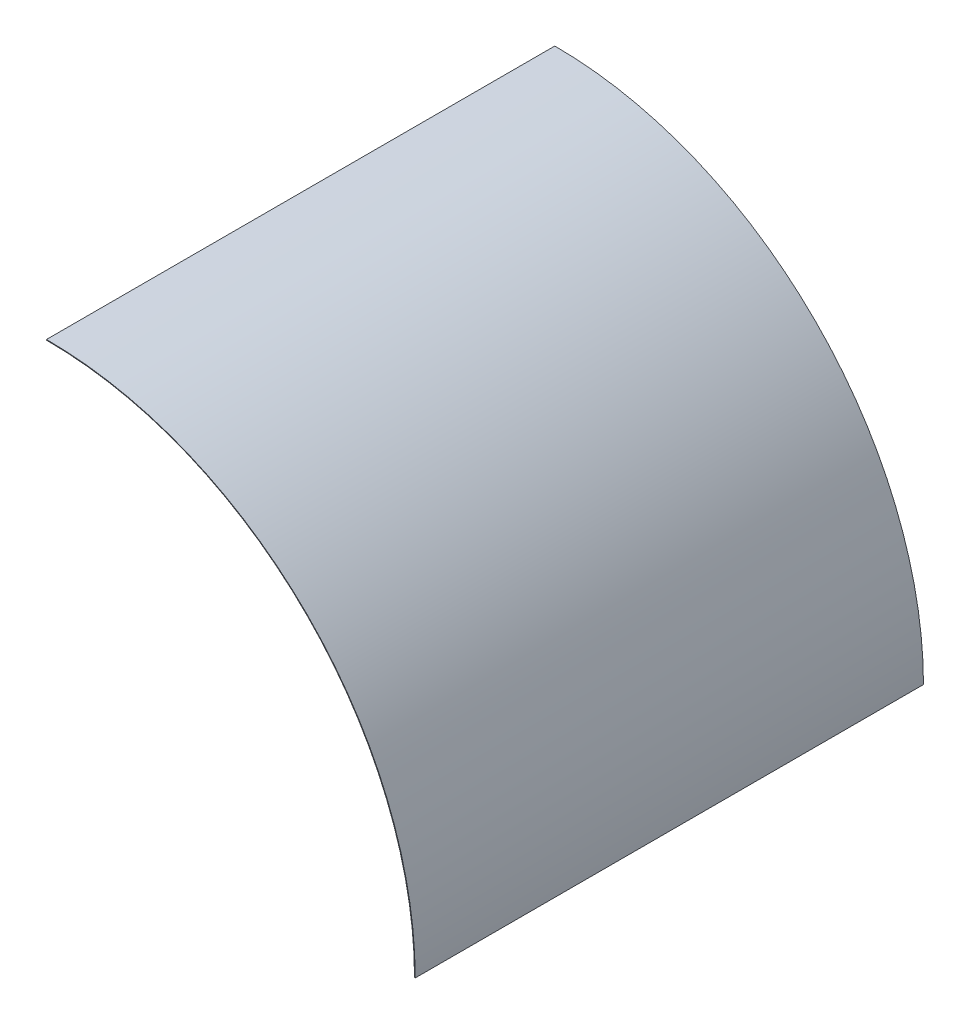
from build123d import *

# Parameters (mm, degrees)
BOSS_EXTRUDE1_DEPTH = 3000


with BuildPart() as part:
    # Sketch1 → Boss-Extrude1 (new body)
    with BuildSketch(Plane.XY):
        with BuildLine():
            Line((0, 2176), (0, 2172))
            ThreePointArc((0, 2172), (1535.835928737, 1535.835928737), (2172, 0))
            Line((2172, 0), (2176, 0))
            ThreePointArc((2176, 0), (1538.664355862, 1538.664355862), (0, 2176))
        make_face()
    extrude(amount=-BOSS_EXTRUDE1_DEPTH)


solid = part.part
